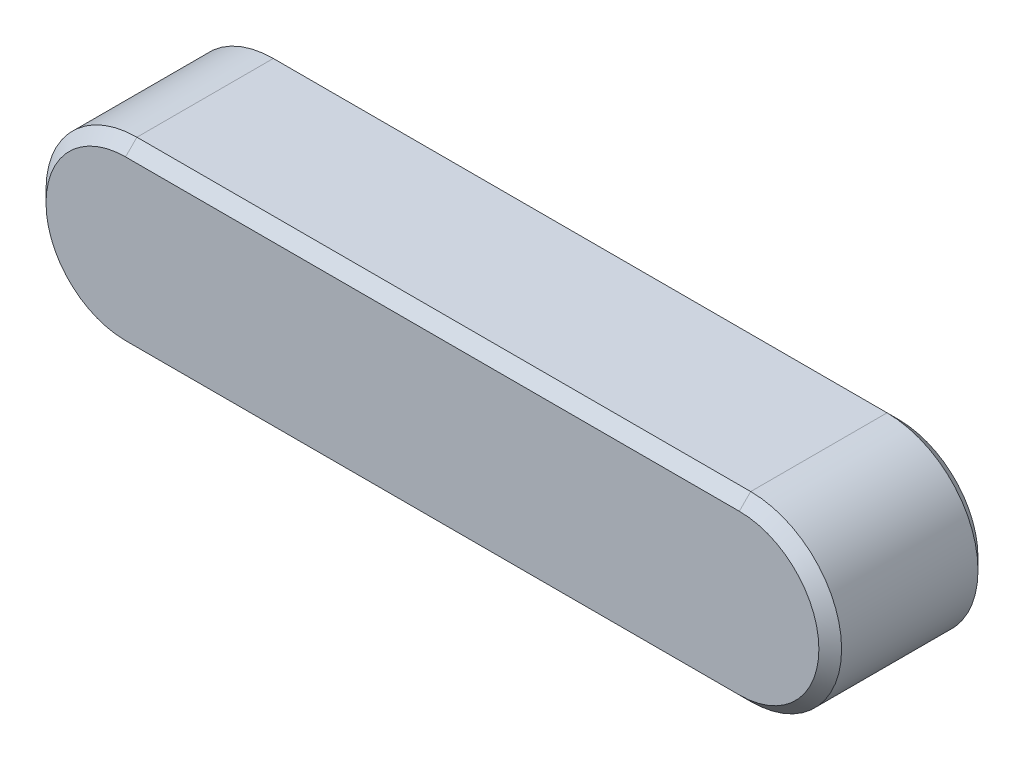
from build123d import *

# Parameters (mm, degrees)
BASE_EXTRUSION_DEPTH      = 3.5
BASE_EXTRUSION_DEPTH_BACK = 3.5
CHANFREIN1_SIZE           = 0.5


with BuildPart() as part:
    # Esquisse1 → Base-Extrusion (new, two sides: drawn at the far end of the back side and taken through both)
    with BuildSketch(Plane.XY.offset(-BASE_EXTRUSION_DEPTH_BACK)):
        with BuildLine():
            Line((-13.5, 4), (13.5, 4))
            ThreePointArc((13.5, 4), (17.5, 0), (13.5, -4))
            Line((13.5, -4), (-13.5, -4))
            ThreePointArc((-13.5, -4), (-17.5, 0), (-13.5, 4))
        make_face()
    extrude(amount=BASE_EXTRUSION_DEPTH + BASE_EXTRUSION_DEPTH_BACK)

    # Chanfrein1
    chanfrein1_edges = [part.edges().sort_by_distance(p)[0] for p in [
        (17.5, 0, 3.5),
        (17.5, 0, -3.5),
        (0, 4, 3.5),
        (0, 4, -3.5),
        (-17.5, 0, 3.5),
        (-17.5, 0, -3.5),
        (0, -4, -3.5),
        (0, -4, 3.5),
    ]]
    chamfer(chanfrein1_edges, length=CHANFREIN1_SIZE)


solid = part.part
